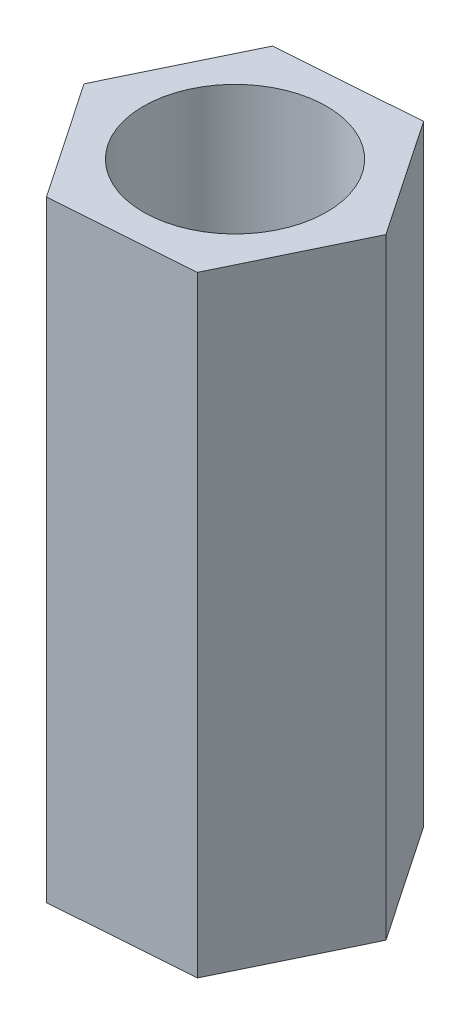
from build123d import *

# Parameters (mm, degrees)
SKETCH1_R           = 1.5
BOSS_EXTRUDE1_DEPTH = 10


with BuildPart() as part:
    # Sketch1 → Boss-Extrude1 (new body)
    with BuildSketch(Plane(origin=(0, 0, 0), x_dir=(1, 0, 0), z_dir=(0, 1, 0))):
        Polygon((1.296458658, -1.911158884), (2.303341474, 0.167186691), (1.006882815, 2.078345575), (-1.296458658, 1.911158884), (-2.303341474, -0.167186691), (-1.006882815, -2.078345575), align=None)
        with Locations(Location((0, 0, 0), (0, 0, 270))):
            Circle(SKETCH1_R, mode=Mode.SUBTRACT)
    extrude(amount=BOSS_EXTRUDE1_DEPTH)


solid = part.part
